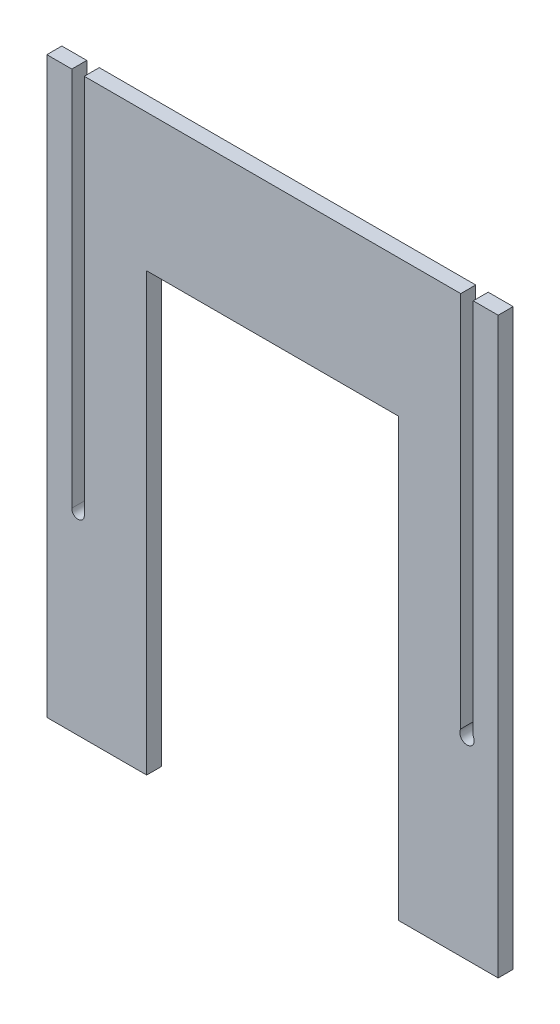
from build123d import *

# Parameters (mm, degrees)
BOSS_EXTRUDE2_DEPTH = 12


with BuildPart() as part:
    # Sketch1 → Boss-Extrude2 (new body)
    with BuildSketch(Plane.XY):
        with BuildLine():
            Line((255.491366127, 26.175370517), (-46.186636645, 26.175370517))
            Line((-46.186636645, 26.175370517), (-46.186636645, -278.557330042))
            ThreePointArc((-46.186636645, -278.557330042), (-51.186636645, -283.831769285), (-56.186636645, -278.557330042))
            Line((-56.186636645, -278.557330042), (-56.186636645, 26.175370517))
            Line((-56.186636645, 26.175370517), (-76.186636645, 26.175370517))
            Line((-76.186636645, 26.175370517), (-76.186636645, -433.824629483))
            Line((-76.186636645, -433.824629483), (3.813363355, -433.824629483))
            Line((3.813363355, -433.824629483), (3.813363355, -83.824629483))
            Line((3.813363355, -83.824629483), (205.491366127, -83.824629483))
            Line((205.491366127, -83.824629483), (205.491366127, -433.824629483))
            Line((205.491366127, -433.824629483), (285.491366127, -433.824629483))
            Line((285.491366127, -433.824629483), (285.491366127, 26.175370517))
            Line((285.491366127, 26.175370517), (265.491366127, 26.175370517))
            Line((265.491366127, 26.175370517), (265.491366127, -275.955106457))
            ThreePointArc((265.491366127, -275.955106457), (260.491366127, -284.589537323), (255.491366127, -275.955106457))
            Line((255.491366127, -275.955106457), (255.491366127, 26.175370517))
        make_face()
    extrude(amount=BOSS_EXTRUDE2_DEPTH)


solid = part.part
